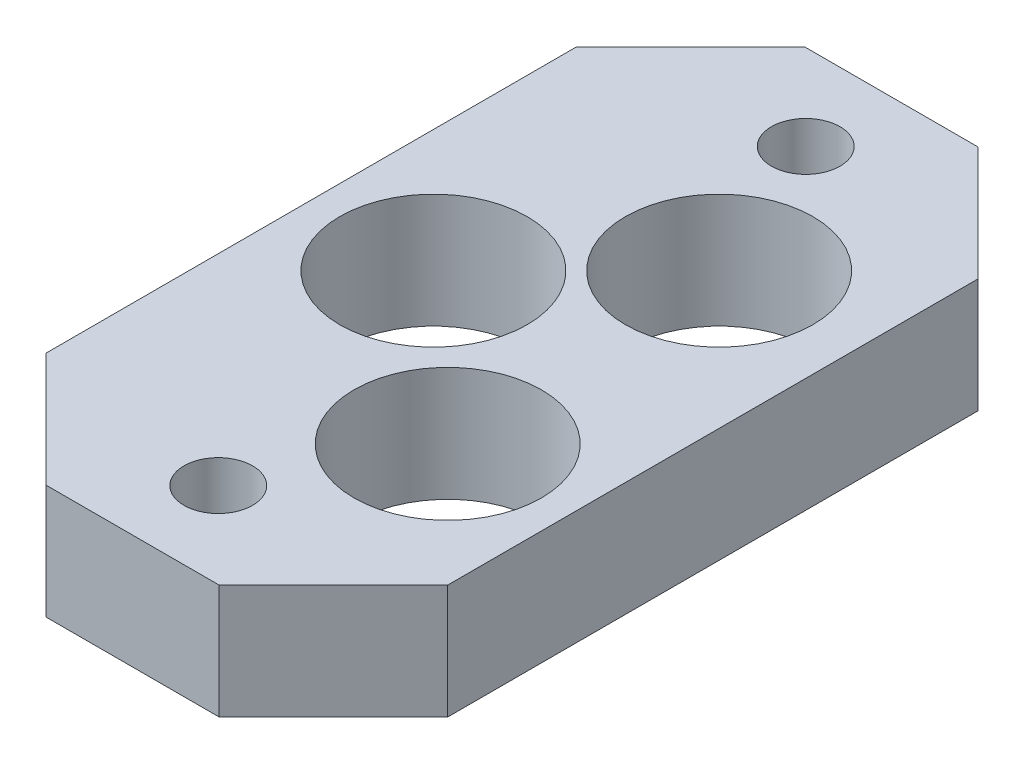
ISO-10303-21;
HEADER;
FILE_DESCRIPTION(('STEP AP214'),'2;1');
FILE_NAME('part.step','',(''),(''),'','','');
FILE_SCHEMA(('AUTOMOTIVE_DESIGN { 1 0 10303 214 1 1 1 1 }'));
ENDSEC;
DATA;
#1=APPLICATION_CONTEXT('core data for automotive mechanical design processes');
#2=APPLICATION_PROTOCOL_DEFINITION('international standard','automotive_design',2000,#1);
#3=PRODUCT_CONTEXT('',#1,'mechanical');
#4=PRODUCT('Part','Part','',(#3));
#5=PRODUCT_RELATED_PRODUCT_CATEGORY('part','',(#4));
#6=PRODUCT_DEFINITION_FORMATION('','',#4);
#7=PRODUCT_DEFINITION_CONTEXT('part definition',#1,'design');
#8=PRODUCT_DEFINITION('design','',#6,#7);
#9=PRODUCT_DEFINITION_SHAPE('','',#8);
#10=(LENGTH_UNIT() NAMED_UNIT(*) SI_UNIT(.MILLI.,.METRE.));
#11=(NAMED_UNIT(*) PLANE_ANGLE_UNIT() SI_UNIT($,.RADIAN.));
#12=(NAMED_UNIT(*) SI_UNIT($,.STERADIAN.) SOLID_ANGLE_UNIT());
#13=UNCERTAINTY_MEASURE_WITH_UNIT(LENGTH_MEASURE(1.E-05),#10,'distance_accuracy_value','');
#14=(GEOMETRIC_REPRESENTATION_CONTEXT(3) GLOBAL_UNCERTAINTY_ASSIGNED_CONTEXT((#13)) GLOBAL_UNIT_ASSIGNED_CONTEXT((#10,
#11,#12)) REPRESENTATION_CONTEXT('',''));
#15=CARTESIAN_POINT('',(0.,0.,0.));
#16=DIRECTION('',(0.,0.,1.));
#17=DIRECTION('',(1.,0.,0.));
#18=AXIS2_PLACEMENT_3D('',#15,#16,#17);
#19=CARTESIAN_POINT('',(0.,4.,0.));
#20=DIRECTION('',(0.,1.,0.));
#21=DIRECTION('',(0.,0.,1.));
#22=AXIS2_PLACEMENT_3D('',#19,#20,#21);
#23=PLANE('',#22);
#24=CARTESIAN_POINT('',(-38.,4.,5.));
#25=DIRECTION('',(0.,1.,0.));
#26=DIRECTION('',(0.,0.,1.));
#27=AXIS2_PLACEMENT_3D('',#24,#25,#26);
#28=CIRCLE('',#27,3.28000000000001);
#29=CARTESIAN_POINT('',(-38.,4.,8.28000000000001));
#30=VERTEX_POINT('',#29);
#31=EDGE_CURVE('E194',#30,#30,#28,.T.);
#32=ORIENTED_EDGE('',*,*,#31,.F.);
#33=EDGE_LOOP('',(#32));
#34=FACE_BOUND('',#33,.T.);
#35=CARTESIAN_POINT('',(-38.5,4.,-5.));
#36=DIRECTION('',(0.,1.,0.));
#37=DIRECTION('',(0.,0.,1.));
#38=AXIS2_PLACEMENT_3D('',#35,#36,#37);
#39=CIRCLE('',#38,3.28000000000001);
#40=CARTESIAN_POINT('',(-38.5,4.,-1.71999999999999));
#41=VERTEX_POINT('',#40);
#42=EDGE_CURVE('E182',#41,#41,#39,.T.);
#43=ORIENTED_EDGE('',*,*,#42,.F.);
#44=EDGE_LOOP('',(#43));
#45=FACE_BOUND('',#44,.T.);
#46=DIRECTION('',(0.,0.,1.));
#47=VECTOR('',#46,1.);
#48=CARTESIAN_POINT('',(-47.78,4.,9.28000000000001));
#49=LINE('',#48,#47);
#50=CARTESIAN_POINT('',(-47.78,4.,-9.28000000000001));
#51=VERTEX_POINT('',#50);
#52=CARTESIAN_POINT('',(-47.78,4.,9.28000000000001));
#53=VERTEX_POINT('',#52);
#54=EDGE_CURVE('E145',#51,#53,#49,.T.);
#55=ORIENTED_EDGE('',*,*,#54,.T.);
#56=DIRECTION('',(0.707106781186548,0.,0.707106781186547));
#57=VECTOR('',#56,1.);
#58=CARTESIAN_POINT('',(-43.78,4.,13.28));
#59=LINE('',#58,#57);
#60=CARTESIAN_POINT('',(-43.78,4.,13.28));
#61=VERTEX_POINT('',#60);
#62=EDGE_CURVE('E93',#53,#61,#59,.T.);
#63=ORIENTED_EDGE('',*,*,#62,.T.);
#64=DIRECTION('',(1.,0.,0.));
#65=VECTOR('',#64,1.);
#66=CARTESIAN_POINT('',(-37.72,4.,13.28));
#67=LINE('',#66,#65);
#68=CARTESIAN_POINT('',(-37.72,4.,13.28));
#69=VERTEX_POINT('',#68);
#70=EDGE_CURVE('E160',#61,#69,#67,.T.);
#71=ORIENTED_EDGE('',*,*,#70,.T.);
#72=DIRECTION('',(0.707106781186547,0.,-0.707106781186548));
#73=VECTOR('',#72,1.);
#74=CARTESIAN_POINT('',(-33.72,4.,9.28000000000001));
#75=LINE('',#74,#73);
#76=CARTESIAN_POINT('',(-33.72,4.,9.28000000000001));
#77=VERTEX_POINT('',#76);
#78=EDGE_CURVE('E173',#69,#77,#75,.T.);
#79=ORIENTED_EDGE('',*,*,#78,.T.);
#80=DIRECTION('',(0.,0.,-1.));
#81=VECTOR('',#80,1.);
#82=CARTESIAN_POINT('',(-33.72,4.,-9.28000000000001));
#83=LINE('',#82,#81);
#84=CARTESIAN_POINT('',(-33.72,4.,-9.28000000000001));
#85=VERTEX_POINT('',#84);
#86=EDGE_CURVE('E112',#77,#85,#83,.T.);
#87=ORIENTED_EDGE('',*,*,#86,.T.);
#88=DIRECTION('',(-0.707106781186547,0.,-0.707106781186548));
#89=VECTOR('',#88,1.);
#90=CARTESIAN_POINT('',(-33.72,4.,-9.28000000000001));
#91=LINE('',#90,#89);
#92=CARTESIAN_POINT('',(-37.72,4.,-13.28));
#93=VERTEX_POINT('',#92);
#94=EDGE_CURVE('E106',#85,#93,#91,.T.);
#95=ORIENTED_EDGE('',*,*,#94,.T.);
#96=DIRECTION('',(-1.,0.,0.));
#97=VECTOR('',#96,1.);
#98=CARTESIAN_POINT('',(-37.72,4.,-13.28));
#99=LINE('',#98,#97);
#100=CARTESIAN_POINT('',(-43.78,4.,-13.28));
#101=VERTEX_POINT('',#100);
#102=EDGE_CURVE('E110',#93,#101,#99,.T.);
#103=ORIENTED_EDGE('',*,*,#102,.T.);
#104=DIRECTION('',(-0.707106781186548,0.,0.707106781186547));
#105=VECTOR('',#104,1.);
#106=CARTESIAN_POINT('',(-47.78,4.,-9.28000000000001));
#107=LINE('',#106,#105);
#108=EDGE_CURVE('E50',#101,#51,#107,.T.);
#109=ORIENTED_EDGE('',*,*,#108,.T.);
#110=EDGE_LOOP('',(#55,#63,#71,#79,#87,#95,#103,#109));
#111=FACE_BOUND('',#110,.T.);
#112=CARTESIAN_POINT('',(-40.75,4.,-10.28));
#113=DIRECTION('',(0.,1.,0.));
#114=DIRECTION('',(0.,0.,1.));
#115=AXIS2_PLACEMENT_3D('',#112,#113,#114);
#116=CIRCLE('',#115,1.2);
#117=CARTESIAN_POINT('',(-40.75,4.,-9.08000000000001));
#118=VERTEX_POINT('',#117);
#119=EDGE_CURVE('E134',#118,#118,#116,.T.);
#120=ORIENTED_EDGE('',*,*,#119,.F.);
#121=EDGE_LOOP('',(#120));
#122=FACE_BOUND('',#121,.T.);
#123=CARTESIAN_POINT('',(-43.5,4.,0.));
#124=DIRECTION('',(0.,1.,0.));
#125=DIRECTION('',(0.,0.,1.));
#126=AXIS2_PLACEMENT_3D('',#123,#124,#125);
#127=CIRCLE('',#126,3.28000000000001);
#128=CARTESIAN_POINT('',(-43.5,4.,3.28000000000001));
#129=VERTEX_POINT('',#128);
#130=EDGE_CURVE('E188',#129,#129,#127,.T.);
#131=ORIENTED_EDGE('',*,*,#130,.F.);
#132=EDGE_LOOP('',(#131));
#133=FACE_BOUND('',#132,.T.);
#134=CARTESIAN_POINT('',(-40.75,4.,10.28));
#135=DIRECTION('',(0.,1.,0.));
#136=DIRECTION('',(0.,0.,1.));
#137=AXIS2_PLACEMENT_3D('',#134,#135,#136);
#138=CIRCLE('',#137,1.2);
#139=CARTESIAN_POINT('',(-40.75,4.,11.48));
#140=VERTEX_POINT('',#139);
#141=EDGE_CURVE('E200',#140,#140,#138,.T.);
#142=ORIENTED_EDGE('',*,*,#141,.F.);
#143=EDGE_LOOP('',(#142));
#144=FACE_BOUND('',#143,.T.);
#145=ADVANCED_FACE('F33',(#34,#45,#111,#122,#133,#144),#23,.T.);
#146=CARTESIAN_POINT('',(0.,0.,0.));
#147=DIRECTION('',(0.,1.,0.));
#148=DIRECTION('',(0.,0.,1.));
#149=AXIS2_PLACEMENT_3D('',#146,#147,#148);
#150=PLANE('',#149);
#151=CARTESIAN_POINT('',(-38.,0.,5.));
#152=DIRECTION('',(0.,1.,0.));
#153=DIRECTION('',(0.,0.,1.));
#154=AXIS2_PLACEMENT_3D('',#151,#152,#153);
#155=CIRCLE('',#154,3.28000000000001);
#156=CARTESIAN_POINT('',(-38.,0.,8.28000000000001));
#157=VERTEX_POINT('',#156);
#158=EDGE_CURVE('E197',#157,#157,#155,.T.);
#159=ORIENTED_EDGE('',*,*,#158,.T.);
#160=EDGE_LOOP('',(#159));
#161=FACE_BOUND('',#160,.T.);
#162=CARTESIAN_POINT('',(-38.5,0.,-5.));
#163=DIRECTION('',(0.,1.,0.));
#164=DIRECTION('',(0.,0.,1.));
#165=AXIS2_PLACEMENT_3D('',#162,#163,#164);
#166=CIRCLE('',#165,3.28000000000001);
#167=CARTESIAN_POINT('',(-38.5,0.,-1.71999999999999));
#168=VERTEX_POINT('',#167);
#169=EDGE_CURVE('E185',#168,#168,#166,.T.);
#170=ORIENTED_EDGE('',*,*,#169,.T.);
#171=EDGE_LOOP('',(#170));
#172=FACE_BOUND('',#171,.T.);
#173=DIRECTION('',(0.,0.,1.));
#174=VECTOR('',#173,1.);
#175=CARTESIAN_POINT('',(-47.78,0.,9.28000000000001));
#176=LINE('',#175,#174);
#177=CARTESIAN_POINT('',(-47.78,0.,-9.28000000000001));
#178=VERTEX_POINT('',#177);
#179=CARTESIAN_POINT('',(-47.78,0.,9.28000000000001));
#180=VERTEX_POINT('',#179);
#181=EDGE_CURVE('E130',#178,#180,#176,.T.);
#182=ORIENTED_EDGE('',*,*,#181,.F.);
#183=DIRECTION('',(-0.707106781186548,0.,0.707106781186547));
#184=VECTOR('',#183,1.);
#185=CARTESIAN_POINT('',(-47.78,0.,-9.28000000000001));
#186=LINE('',#185,#184);
#187=CARTESIAN_POINT('',(-43.78,0.,-13.28));
#188=VERTEX_POINT('',#187);
#189=EDGE_CURVE('E85',#188,#178,#186,.T.);
#190=ORIENTED_EDGE('',*,*,#189,.F.);
#191=DIRECTION('',(-1.,0.,0.));
#192=VECTOR('',#191,1.);
#193=CARTESIAN_POINT('',(-37.72,0.,-13.28));
#194=LINE('',#193,#192);
#195=CARTESIAN_POINT('',(-37.72,0.,-13.28));
#196=VERTEX_POINT('',#195);
#197=EDGE_CURVE('E79',#196,#188,#194,.T.);
#198=ORIENTED_EDGE('',*,*,#197,.F.);
#199=DIRECTION('',(-0.707106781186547,0.,-0.707106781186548));
#200=VECTOR('',#199,1.);
#201=CARTESIAN_POINT('',(-33.72,0.,-9.28000000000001));
#202=LINE('',#201,#200);
#203=CARTESIAN_POINT('',(-33.72,0.,-9.28000000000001));
#204=VERTEX_POINT('',#203);
#205=EDGE_CURVE('E120',#204,#196,#202,.T.);
#206=ORIENTED_EDGE('',*,*,#205,.F.);
#207=DIRECTION('',(0.,0.,-1.));
#208=VECTOR('',#207,1.);
#209=CARTESIAN_POINT('',(-33.72,0.,-9.28000000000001));
#210=LINE('',#209,#208);
#211=CARTESIAN_POINT('',(-33.72,0.,9.28000000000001));
#212=VERTEX_POINT('',#211);
#213=EDGE_CURVE('E140',#212,#204,#210,.T.);
#214=ORIENTED_EDGE('',*,*,#213,.F.);
#215=DIRECTION('',(0.707106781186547,0.,-0.707106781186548));
#216=VECTOR('',#215,1.);
#217=CARTESIAN_POINT('',(-33.72,0.,9.28000000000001));
#218=LINE('',#217,#216);
#219=CARTESIAN_POINT('',(-37.72,0.,13.28));
#220=VERTEX_POINT('',#219);
#221=EDGE_CURVE('E138',#220,#212,#218,.T.);
#222=ORIENTED_EDGE('',*,*,#221,.F.);
#223=DIRECTION('',(1.,0.,0.));
#224=VECTOR('',#223,1.);
#225=CARTESIAN_POINT('',(-37.72,0.,13.28));
#226=LINE('',#225,#224);
#227=CARTESIAN_POINT('',(-43.78,0.,13.28));
#228=VERTEX_POINT('',#227);
#229=EDGE_CURVE('E136',#228,#220,#226,.T.);
#230=ORIENTED_EDGE('',*,*,#229,.F.);
#231=DIRECTION('',(0.707106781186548,0.,0.707106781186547));
#232=VECTOR('',#231,1.);
#233=CARTESIAN_POINT('',(-43.78,0.,13.28));
#234=LINE('',#233,#232);
#235=EDGE_CURVE('E133',#180,#228,#234,.T.);
#236=ORIENTED_EDGE('',*,*,#235,.F.);
#237=EDGE_LOOP('',(#182,#190,#198,#206,#214,#222,#230,#236));
#238=FACE_BOUND('',#237,.T.);
#239=CARTESIAN_POINT('',(-40.75,0.,-10.28));
#240=DIRECTION('',(0.,1.,0.));
#241=DIRECTION('',(0.,0.,1.));
#242=AXIS2_PLACEMENT_3D('',#239,#240,#241);
#243=CIRCLE('',#242,1.2);
#244=CARTESIAN_POINT('',(-40.75,0.,-9.08000000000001));
#245=VERTEX_POINT('',#244);
#246=EDGE_CURVE('E179',#245,#245,#243,.T.);
#247=ORIENTED_EDGE('',*,*,#246,.T.);
#248=EDGE_LOOP('',(#247));
#249=FACE_BOUND('',#248,.T.);
#250=CARTESIAN_POINT('',(-43.5,0.,0.));
#251=DIRECTION('',(0.,1.,0.));
#252=DIRECTION('',(0.,0.,1.));
#253=AXIS2_PLACEMENT_3D('',#250,#251,#252);
#254=CIRCLE('',#253,3.28000000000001);
#255=CARTESIAN_POINT('',(-43.5,0.,3.28000000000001));
#256=VERTEX_POINT('',#255);
#257=EDGE_CURVE('E191',#256,#256,#254,.T.);
#258=ORIENTED_EDGE('',*,*,#257,.T.);
#259=EDGE_LOOP('',(#258));
#260=FACE_BOUND('',#259,.T.);
#261=CARTESIAN_POINT('',(-40.75,0.,10.28));
#262=DIRECTION('',(0.,1.,0.));
#263=DIRECTION('',(0.,0.,1.));
#264=AXIS2_PLACEMENT_3D('',#261,#262,#263);
#265=CIRCLE('',#264,1.2);
#266=CARTESIAN_POINT('',(-40.75,0.,11.48));
#267=VERTEX_POINT('',#266);
#268=EDGE_CURVE('E203',#267,#267,#265,.T.);
#269=ORIENTED_EDGE('',*,*,#268,.T.);
#270=EDGE_LOOP('',(#269));
#271=FACE_BOUND('',#270,.T.);
#272=ADVANCED_FACE('F164',(#161,#172,#238,#249,#260,#271),#150,.F.);
#273=CARTESIAN_POINT('',(-47.78,4.,9.28000000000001));
#274=DIRECTION('',(1.,0.,0.));
#275=DIRECTION('',(0.,0.,-1.));
#276=AXIS2_PLACEMENT_3D('',#273,#274,#275);
#277=PLANE('',#276);
#278=ORIENTED_EDGE('',*,*,#181,.T.);
#279=DIRECTION('',(0.,-1.,0.));
#280=VECTOR('',#279,1.);
#281=CARTESIAN_POINT('',(-47.78,4.,9.28000000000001));
#282=LINE('',#281,#280);
#283=EDGE_CURVE('E11',#53,#180,#282,.T.);
#284=ORIENTED_EDGE('',*,*,#283,.F.);
#285=ORIENTED_EDGE('',*,*,#54,.F.);
#286=DIRECTION('',(0.,-1.,0.));
#287=VECTOR('',#286,1.);
#288=CARTESIAN_POINT('',(-47.78,4.,-9.28000000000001));
#289=LINE('',#288,#287);
#290=EDGE_CURVE('E126',#51,#178,#289,.T.);
#291=ORIENTED_EDGE('',*,*,#290,.T.);
#292=EDGE_LOOP('',(#278,#284,#285,#291));
#293=FACE_BOUND('',#292,.T.);
#294=ADVANCED_FACE('F35',(#293),#277,.F.);
#295=CARTESIAN_POINT('',(-43.78,4.,13.28));
#296=DIRECTION('',(0.707106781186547,0.,-0.707106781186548));
#297=DIRECTION('',(-0.707106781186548,0.,-0.707106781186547));
#298=AXIS2_PLACEMENT_3D('',#295,#296,#297);
#299=PLANE('',#298);
#300=ORIENTED_EDGE('',*,*,#235,.T.);
#301=DIRECTION('',(0.,-1.,0.));
#302=VECTOR('',#301,1.);
#303=CARTESIAN_POINT('',(-43.78,4.,13.28));
#304=LINE('',#303,#302);
#305=EDGE_CURVE('E42',#61,#228,#304,.T.);
#306=ORIENTED_EDGE('',*,*,#305,.F.);
#307=ORIENTED_EDGE('',*,*,#62,.F.);
#308=ORIENTED_EDGE('',*,*,#283,.T.);
#309=EDGE_LOOP('',(#300,#306,#307,#308));
#310=FACE_BOUND('',#309,.T.);
#311=ADVANCED_FACE('F238',(#310),#299,.F.);
#312=CARTESIAN_POINT('',(-37.72,4.,13.28));
#313=DIRECTION('',(0.,0.,-1.));
#314=DIRECTION('',(-1.,0.,0.));
#315=AXIS2_PLACEMENT_3D('',#312,#313,#314);
#316=PLANE('',#315);
#317=ORIENTED_EDGE('',*,*,#229,.T.);
#318=DIRECTION('',(0.,-1.,0.));
#319=VECTOR('',#318,1.);
#320=CARTESIAN_POINT('',(-37.72,4.,13.28));
#321=LINE('',#320,#319);
#322=EDGE_CURVE('E152',#69,#220,#321,.T.);
#323=ORIENTED_EDGE('',*,*,#322,.F.);
#324=ORIENTED_EDGE('',*,*,#70,.F.);
#325=ORIENTED_EDGE('',*,*,#305,.T.);
#326=EDGE_LOOP('',(#317,#323,#324,#325));
#327=FACE_BOUND('',#326,.T.);
#328=ADVANCED_FACE('F158',(#327),#316,.F.);
#329=CARTESIAN_POINT('',(-33.72,4.,9.28000000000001));
#330=DIRECTION('',(-0.707106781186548,0.,-0.707106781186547));
#331=DIRECTION('',(-0.707106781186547,0.,0.707106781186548));
#332=AXIS2_PLACEMENT_3D('',#329,#330,#331);
#333=PLANE('',#332);
#334=ORIENTED_EDGE('',*,*,#221,.T.);
#335=DIRECTION('',(0.,-1.,0.));
#336=VECTOR('',#335,1.);
#337=CARTESIAN_POINT('',(-33.72,4.,9.28000000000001));
#338=LINE('',#337,#336);
#339=EDGE_CURVE('E149',#77,#212,#338,.T.);
#340=ORIENTED_EDGE('',*,*,#339,.F.);
#341=ORIENTED_EDGE('',*,*,#78,.F.);
#342=ORIENTED_EDGE('',*,*,#322,.T.);
#343=EDGE_LOOP('',(#334,#340,#341,#342));
#344=FACE_BOUND('',#343,.T.);
#345=ADVANCED_FACE('F169',(#344),#333,.F.);
#346=CARTESIAN_POINT('',(-33.72,4.,-9.28000000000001));
#347=DIRECTION('',(-1.,0.,0.));
#348=DIRECTION('',(0.,0.,1.));
#349=AXIS2_PLACEMENT_3D('',#346,#347,#348);
#350=PLANE('',#349);
#351=ORIENTED_EDGE('',*,*,#213,.T.);
#352=DIRECTION('',(0.,-1.,0.));
#353=VECTOR('',#352,1.);
#354=CARTESIAN_POINT('',(-33.72,4.,-9.28000000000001));
#355=LINE('',#354,#353);
#356=EDGE_CURVE('E121',#85,#204,#355,.T.);
#357=ORIENTED_EDGE('',*,*,#356,.F.);
#358=ORIENTED_EDGE('',*,*,#86,.F.);
#359=ORIENTED_EDGE('',*,*,#339,.T.);
#360=EDGE_LOOP('',(#351,#357,#358,#359));
#361=FACE_BOUND('',#360,.T.);
#362=ADVANCED_FACE('F172',(#361),#350,.F.);
#363=CARTESIAN_POINT('',(-33.72,4.,-9.28000000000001));
#364=DIRECTION('',(-0.707106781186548,0.,0.707106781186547));
#365=DIRECTION('',(0.707106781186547,0.,0.707106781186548));
#366=AXIS2_PLACEMENT_3D('',#363,#364,#365);
#367=PLANE('',#366);
#368=ORIENTED_EDGE('',*,*,#205,.T.);
#369=DIRECTION('',(0.,-1.,0.));
#370=VECTOR('',#369,1.);
#371=CARTESIAN_POINT('',(-37.72,4.,-13.28));
#372=LINE('',#371,#370);
#373=EDGE_CURVE('E117',#93,#196,#372,.T.);
#374=ORIENTED_EDGE('',*,*,#373,.F.);
#375=ORIENTED_EDGE('',*,*,#94,.F.);
#376=ORIENTED_EDGE('',*,*,#356,.T.);
#377=EDGE_LOOP('',(#368,#374,#375,#376));
#378=FACE_BOUND('',#377,.T.);
#379=ADVANCED_FACE('F118',(#378),#367,.F.);
#380=CARTESIAN_POINT('',(-37.72,4.,-13.28));
#381=DIRECTION('',(0.,0.,1.));
#382=DIRECTION('',(1.,0.,0.));
#383=AXIS2_PLACEMENT_3D('',#380,#381,#382);
#384=PLANE('',#383);
#385=ORIENTED_EDGE('',*,*,#197,.T.);
#386=DIRECTION('',(0.,-1.,0.));
#387=VECTOR('',#386,1.);
#388=CARTESIAN_POINT('',(-43.78,4.,-13.28));
#389=LINE('',#388,#387);
#390=EDGE_CURVE('E122',#101,#188,#389,.T.);
#391=ORIENTED_EDGE('',*,*,#390,.F.);
#392=ORIENTED_EDGE('',*,*,#102,.F.);
#393=ORIENTED_EDGE('',*,*,#373,.T.);
#394=EDGE_LOOP('',(#385,#391,#392,#393));
#395=FACE_BOUND('',#394,.T.);
#396=ADVANCED_FACE('F124',(#395),#384,.F.);
#397=CARTESIAN_POINT('',(-47.78,4.,-9.28000000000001));
#398=DIRECTION('',(0.707106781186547,0.,0.707106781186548));
#399=DIRECTION('',(0.707106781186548,0.,-0.707106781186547));
#400=AXIS2_PLACEMENT_3D('',#397,#398,#399);
#401=PLANE('',#400);
#402=ORIENTED_EDGE('',*,*,#189,.T.);
#403=ORIENTED_EDGE('',*,*,#290,.F.);
#404=ORIENTED_EDGE('',*,*,#108,.F.);
#405=ORIENTED_EDGE('',*,*,#390,.T.);
#406=EDGE_LOOP('',(#402,#403,#404,#405));
#407=FACE_BOUND('',#406,.T.);
#408=ADVANCED_FACE('F226',(#407),#401,.F.);
#409=CARTESIAN_POINT('',(-40.75,4.,-10.28));
#410=DIRECTION('',(0.,-1.,0.));
#411=DIRECTION('',(0.,0.,-1.));
#412=AXIS2_PLACEMENT_3D('',#409,#410,#411);
#413=CYLINDRICAL_SURFACE('',#412,1.2);
#414=ORIENTED_EDGE('',*,*,#119,.T.);
#415=EDGE_LOOP('',(#414));
#416=FACE_BOUND('',#415,.T.);
#417=ORIENTED_EDGE('',*,*,#246,.F.);
#418=EDGE_LOOP('',(#417));
#419=FACE_BOUND('',#418,.T.);
#420=ADVANCED_FACE('F223',(#416,#419),#413,.F.);
#421=CARTESIAN_POINT('',(-38.5,4.,-5.));
#422=DIRECTION('',(0.,-1.,0.));
#423=DIRECTION('',(0.,0.,-1.));
#424=AXIS2_PLACEMENT_3D('',#421,#422,#423);
#425=CYLINDRICAL_SURFACE('',#424,3.28000000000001);
#426=ORIENTED_EDGE('',*,*,#42,.T.);
#427=EDGE_LOOP('',(#426));
#428=FACE_BOUND('',#427,.T.);
#429=ORIENTED_EDGE('',*,*,#169,.F.);
#430=EDGE_LOOP('',(#429));
#431=FACE_BOUND('',#430,.T.);
#432=ADVANCED_FACE('F302',(#428,#431),#425,.F.);
#433=CARTESIAN_POINT('',(-43.5,4.,0.));
#434=DIRECTION('',(0.,-1.,0.));
#435=DIRECTION('',(0.,0.,-1.));
#436=AXIS2_PLACEMENT_3D('',#433,#434,#435);
#437=CYLINDRICAL_SURFACE('',#436,3.28000000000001);
#438=ORIENTED_EDGE('',*,*,#130,.T.);
#439=EDGE_LOOP('',(#438));
#440=FACE_BOUND('',#439,.T.);
#441=ORIENTED_EDGE('',*,*,#257,.F.);
#442=EDGE_LOOP('',(#441));
#443=FACE_BOUND('',#442,.T.);
#444=ADVANCED_FACE('F310',(#440,#443),#437,.F.);
#445=CARTESIAN_POINT('',(-38.,4.,5.));
#446=DIRECTION('',(0.,-1.,0.));
#447=DIRECTION('',(0.,0.,-1.));
#448=AXIS2_PLACEMENT_3D('',#445,#446,#447);
#449=CYLINDRICAL_SURFACE('',#448,3.28000000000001);
#450=ORIENTED_EDGE('',*,*,#31,.T.);
#451=EDGE_LOOP('',(#450));
#452=FACE_BOUND('',#451,.T.);
#453=ORIENTED_EDGE('',*,*,#158,.F.);
#454=EDGE_LOOP('',(#453));
#455=FACE_BOUND('',#454,.T.);
#456=ADVANCED_FACE('F318',(#452,#455),#449,.F.);
#457=CARTESIAN_POINT('',(-40.75,4.,10.28));
#458=DIRECTION('',(0.,-1.,0.));
#459=DIRECTION('',(0.,0.,-1.));
#460=AXIS2_PLACEMENT_3D('',#457,#458,#459);
#461=CYLINDRICAL_SURFACE('',#460,1.2);
#462=ORIENTED_EDGE('',*,*,#141,.T.);
#463=EDGE_LOOP('',(#462));
#464=FACE_BOUND('',#463,.T.);
#465=ORIENTED_EDGE('',*,*,#268,.F.);
#466=EDGE_LOOP('',(#465));
#467=FACE_BOUND('',#466,.T.);
#468=ADVANCED_FACE('F209',(#464,#467),#461,.F.);
#469=CLOSED_SHELL('',(#145,#272,#294,#311,#328,#345,#362,#379,#396,#408,#420,#432,#444,#456,#468));
#470=MANIFOLD_SOLID_BREP('B2',#469);
#471=ADVANCED_BREP_SHAPE_REPRESENTATION('',(#18,#470),#14);
#472=SHAPE_DEFINITION_REPRESENTATION(#9,#471);
ENDSEC;
END-ISO-10303-21;
